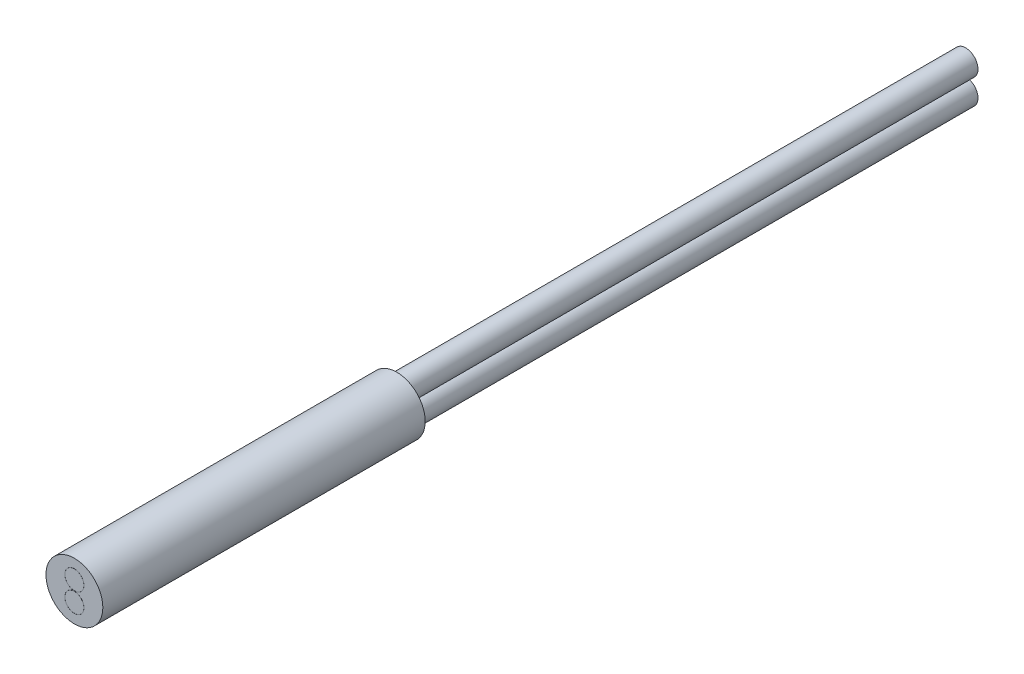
ISO-10303-21;
HEADER;
FILE_DESCRIPTION(('STEP AP214'),'2;1');
FILE_NAME('part.step','',(''),(''),'','','');
FILE_SCHEMA(('AUTOMOTIVE_DESIGN { 1 0 10303 214 1 1 1 1 }'));
ENDSEC;
DATA;
#1=APPLICATION_CONTEXT('core data for automotive mechanical design processes');
#2=APPLICATION_PROTOCOL_DEFINITION('international standard','automotive_design',2000,#1);
#3=PRODUCT_CONTEXT('',#1,'mechanical');
#4=PRODUCT('Part','Part','',(#3));
#5=PRODUCT_RELATED_PRODUCT_CATEGORY('part','',(#4));
#6=PRODUCT_DEFINITION_FORMATION('','',#4);
#7=PRODUCT_DEFINITION_CONTEXT('part definition',#1,'design');
#8=PRODUCT_DEFINITION('design','',#6,#7);
#9=PRODUCT_DEFINITION_SHAPE('','',#8);
#10=(LENGTH_UNIT() NAMED_UNIT(*) SI_UNIT(.MILLI.,.METRE.));
#11=(NAMED_UNIT(*) PLANE_ANGLE_UNIT() SI_UNIT($,.RADIAN.));
#12=(NAMED_UNIT(*) SI_UNIT($,.STERADIAN.) SOLID_ANGLE_UNIT());
#13=UNCERTAINTY_MEASURE_WITH_UNIT(LENGTH_MEASURE(1.E-05),#10,'distance_accuracy_value','');
#14=(GEOMETRIC_REPRESENTATION_CONTEXT(3) GLOBAL_UNCERTAINTY_ASSIGNED_CONTEXT((#13)) GLOBAL_UNIT_ASSIGNED_CONTEXT((#10,
#11,#12)) REPRESENTATION_CONTEXT('',''));
#15=CARTESIAN_POINT('',(0.,0.,0.));
#16=DIRECTION('',(0.,0.,1.));
#17=DIRECTION('',(1.,0.,0.));
#18=AXIS2_PLACEMENT_3D('',#15,#16,#17);
#19=CARTESIAN_POINT('',(0.,0.,-17.));
#20=DIRECTION('',(0.,0.,1.));
#21=DIRECTION('',(1.,0.,0.));
#22=AXIS2_PLACEMENT_3D('',#19,#20,#21);
#23=CYLINDRICAL_SURFACE('',#22,1.5);
#24=CARTESIAN_POINT('',(0.,0.,-17.));
#25=DIRECTION('',(0.,0.,1.));
#26=DIRECTION('',(1.,0.,0.));
#27=AXIS2_PLACEMENT_3D('',#24,#25,#26);
#28=CIRCLE('',#27,1.5);
#29=CARTESIAN_POINT('',(1.5,0.,-17.));
#30=VERTEX_POINT('',#29);
#31=EDGE_CURVE('E43',#30,#30,#28,.T.);
#32=ORIENTED_EDGE('',*,*,#31,.T.);
#33=EDGE_LOOP('',(#32));
#34=FACE_BOUND('',#33,.T.);
#35=CARTESIAN_POINT('',(0.,0.,0.));
#36=DIRECTION('',(0.,0.,1.));
#37=DIRECTION('',(1.,0.,0.));
#38=AXIS2_PLACEMENT_3D('',#35,#36,#37);
#39=CIRCLE('',#38,1.5);
#40=CARTESIAN_POINT('',(1.5,0.,0.));
#41=VERTEX_POINT('',#40);
#42=EDGE_CURVE('E47',#41,#41,#39,.T.);
#43=ORIENTED_EDGE('',*,*,#42,.F.);
#44=EDGE_LOOP('',(#43));
#45=FACE_BOUND('',#44,.T.);
#46=ADVANCED_FACE('F33',(#34,#45),#23,.T.);
#47=CARTESIAN_POINT('',(0.,0.,-17.));
#48=DIRECTION('',(0.,0.,1.));
#49=DIRECTION('',(1.,0.,0.));
#50=AXIS2_PLACEMENT_3D('',#47,#48,#49);
#51=PLANE('',#50);
#52=CARTESIAN_POINT('',(0.,-0.66,-17.));
#53=DIRECTION('',(0.,0.,1.));
#54=DIRECTION('',(1.,0.,0.));
#55=AXIS2_PLACEMENT_3D('',#52,#53,#54);
#56=CIRCLE('',#55,0.65);
#57=CARTESIAN_POINT('',(0.65,-0.66,-17.));
#58=VERTEX_POINT('',#57);
#59=EDGE_CURVE('E10',#58,#58,#56,.F.);
#60=ORIENTED_EDGE('',*,*,#59,.F.);
#61=EDGE_LOOP('',(#60));
#62=FACE_BOUND('',#61,.T.);
#63=CARTESIAN_POINT('',(0.,0.66,-17.));
#64=DIRECTION('',(0.,0.,1.));
#65=DIRECTION('',(1.,0.,0.));
#66=AXIS2_PLACEMENT_3D('',#63,#64,#65);
#67=CIRCLE('',#66,0.65);
#68=CARTESIAN_POINT('',(0.65,0.66,-17.));
#69=VERTEX_POINT('',#68);
#70=EDGE_CURVE('E39',#69,#69,#67,.F.);
#71=ORIENTED_EDGE('',*,*,#70,.F.);
#72=EDGE_LOOP('',(#71));
#73=FACE_BOUND('',#72,.T.);
#74=ORIENTED_EDGE('',*,*,#31,.F.);
#75=EDGE_LOOP('',(#74));
#76=FACE_BOUND('',#75,.T.);
#77=ADVANCED_FACE('F103',(#62,#73,#76),#51,.F.);
#78=CARTESIAN_POINT('',(0.,0.,0.));
#79=DIRECTION('',(0.,0.,1.));
#80=DIRECTION('',(1.,0.,0.));
#81=AXIS2_PLACEMENT_3D('',#78,#79,#80);
#82=PLANE('',#81);
#83=CARTESIAN_POINT('',(0.,0.515,0.));
#84=DIRECTION('',(0.,0.,1.));
#85=DIRECTION('',(1.,0.,0.));
#86=AXIS2_PLACEMENT_3D('',#83,#84,#85);
#87=CIRCLE('',#86,0.505);
#88=CARTESIAN_POINT('',(0.505,0.515,0.));
#89=VERTEX_POINT('',#88);
#90=EDGE_CURVE('E72',#89,#89,#87,.T.);
#91=ORIENTED_EDGE('',*,*,#90,.F.);
#92=EDGE_LOOP('',(#91));
#93=FACE_BOUND('',#92,.T.);
#94=CARTESIAN_POINT('',(0.,-0.515,0.));
#95=DIRECTION('',(0.,0.,1.));
#96=DIRECTION('',(1.,0.,0.));
#97=AXIS2_PLACEMENT_3D('',#94,#95,#96);
#98=CIRCLE('',#97,0.505);
#99=CARTESIAN_POINT('',(0.505,-0.515,0.));
#100=VERTEX_POINT('',#99);
#101=EDGE_CURVE('E59',#100,#100,#98,.T.);
#102=ORIENTED_EDGE('',*,*,#101,.F.);
#103=EDGE_LOOP('',(#102));
#104=FACE_BOUND('',#103,.T.);
#105=ORIENTED_EDGE('',*,*,#42,.T.);
#106=EDGE_LOOP('',(#105));
#107=FACE_BOUND('',#106,.T.);
#108=ADVANCED_FACE('F99',(#93,#104,#107),#82,.T.);
#109=CARTESIAN_POINT('',(0.,0.66,-47.));
#110=DIRECTION('',(0.,0.,1.));
#111=DIRECTION('',(1.,0.,0.));
#112=AXIS2_PLACEMENT_3D('',#109,#110,#111);
#113=CYLINDRICAL_SURFACE('',#112,0.65);
#114=CARTESIAN_POINT('',(0.,0.66,-47.));
#115=DIRECTION('',(0.,0.,-1.));
#116=DIRECTION('',(-1.,0.,0.));
#117=AXIS2_PLACEMENT_3D('',#114,#115,#116);
#118=CIRCLE('',#117,0.65);
#119=CARTESIAN_POINT('',(-0.65,0.66,-47.));
#120=VERTEX_POINT('',#119);
#121=EDGE_CURVE('E51',#120,#120,#118,.T.);
#122=ORIENTED_EDGE('',*,*,#121,.F.);
#123=EDGE_LOOP('',(#122));
#124=FACE_BOUND('',#123,.T.);
#125=ORIENTED_EDGE('',*,*,#70,.T.);
#126=EDGE_LOOP('',(#125));
#127=FACE_BOUND('',#126,.T.);
#128=ADVANCED_FACE('F102',(#124,#127),#113,.T.);
#129=CARTESIAN_POINT('',(0.,0.66,-47.));
#130=DIRECTION('',(0.,0.,-1.));
#131=DIRECTION('',(-1.,0.,0.));
#132=AXIS2_PLACEMENT_3D('',#129,#130,#131);
#133=PLANE('',#132);
#134=ORIENTED_EDGE('',*,*,#121,.T.);
#135=EDGE_LOOP('',(#134));
#136=FACE_BOUND('',#135,.T.);
#137=ADVANCED_FACE('F125',(#136),#133,.T.);
#138=CARTESIAN_POINT('',(0.,-0.66,-47.));
#139=DIRECTION('',(0.,0.,1.));
#140=DIRECTION('',(1.,0.,0.));
#141=AXIS2_PLACEMENT_3D('',#138,#139,#140);
#142=CYLINDRICAL_SURFACE('',#141,0.65);
#143=CARTESIAN_POINT('',(0.,-0.66,-47.));
#144=DIRECTION('',(0.,0.,-1.));
#145=DIRECTION('',(-1.,0.,0.));
#146=AXIS2_PLACEMENT_3D('',#143,#144,#145);
#147=CIRCLE('',#146,0.65);
#148=CARTESIAN_POINT('',(-0.65,-0.66,-47.));
#149=VERTEX_POINT('',#148);
#150=EDGE_CURVE('E55',#149,#149,#147,.T.);
#151=ORIENTED_EDGE('',*,*,#150,.F.);
#152=EDGE_LOOP('',(#151));
#153=FACE_BOUND('',#152,.T.);
#154=ORIENTED_EDGE('',*,*,#59,.T.);
#155=EDGE_LOOP('',(#154));
#156=FACE_BOUND('',#155,.T.);
#157=ADVANCED_FACE('F129',(#153,#156),#142,.T.);
#158=CARTESIAN_POINT('',(0.,-0.66,-47.));
#159=DIRECTION('',(0.,0.,-1.));
#160=DIRECTION('',(-1.,0.,0.));
#161=AXIS2_PLACEMENT_3D('',#158,#159,#160);
#162=PLANE('',#161);
#163=ORIENTED_EDGE('',*,*,#150,.T.);
#164=EDGE_LOOP('',(#163));
#165=FACE_BOUND('',#164,.T.);
#166=ADVANCED_FACE('F133',(#165),#162,.T.);
#167=CARTESIAN_POINT('',(0.,-0.515,-0.1));
#168=DIRECTION('',(0.,0.,1.));
#169=DIRECTION('',(1.,0.,0.));
#170=AXIS2_PLACEMENT_3D('',#167,#168,#169);
#171=CYLINDRICAL_SURFACE('',#170,0.505);
#172=CARTESIAN_POINT('',(0.,-0.515,-0.1));
#173=DIRECTION('',(0.,0.,1.));
#174=DIRECTION('',(1.,0.,0.));
#175=AXIS2_PLACEMENT_3D('',#172,#173,#174);
#176=CIRCLE('',#175,0.505);
#177=CARTESIAN_POINT('',(0.505,-0.515,-0.1));
#178=VERTEX_POINT('',#177);
#179=EDGE_CURVE('E62',#178,#178,#176,.T.);
#180=ORIENTED_EDGE('',*,*,#179,.F.);
#181=EDGE_LOOP('',(#180));
#182=FACE_BOUND('',#181,.T.);
#183=ORIENTED_EDGE('',*,*,#101,.T.);
#184=EDGE_LOOP('',(#183));
#185=FACE_BOUND('',#184,.T.);
#186=ADVANCED_FACE('F137',(#182,#185),#171,.F.);
#187=CARTESIAN_POINT('',(0.,-0.515,-0.1));
#188=DIRECTION('',(0.,0.,1.));
#189=DIRECTION('',(1.,0.,0.));
#190=AXIS2_PLACEMENT_3D('',#187,#188,#189);
#191=PLANE('',#190);
#192=CARTESIAN_POINT('',(0.,-0.515,-0.1));
#193=DIRECTION('',(0.,0.,1.));
#194=DIRECTION('',(1.,0.,0.));
#195=AXIS2_PLACEMENT_3D('',#192,#193,#194);
#196=CIRCLE('',#195,0.5);
#197=CARTESIAN_POINT('',(0.5,-0.515,-0.1));
#198=VERTEX_POINT('',#197);
#199=EDGE_CURVE('E63',#198,#198,#196,.T.);
#200=ORIENTED_EDGE('',*,*,#199,.F.);
#201=EDGE_LOOP('',(#200));
#202=FACE_BOUND('',#201,.T.);
#203=ORIENTED_EDGE('',*,*,#179,.T.);
#204=EDGE_LOOP('',(#203));
#205=FACE_BOUND('',#204,.T.);
#206=ADVANCED_FACE('F141',(#202,#205),#191,.T.);
#207=CARTESIAN_POINT('',(0.,-0.515,-0.1));
#208=DIRECTION('',(0.,0.,1.));
#209=DIRECTION('',(1.,0.,0.));
#210=AXIS2_PLACEMENT_3D('',#207,#208,#209);
#211=CYLINDRICAL_SURFACE('',#210,0.5);
#212=ORIENTED_EDGE('',*,*,#199,.T.);
#213=EDGE_LOOP('',(#212));
#214=FACE_BOUND('',#213,.T.);
#215=CARTESIAN_POINT('',(0.,-0.515,0.));
#216=DIRECTION('',(0.,0.,1.));
#217=DIRECTION('',(1.,0.,0.));
#218=AXIS2_PLACEMENT_3D('',#215,#216,#217);
#219=CIRCLE('',#218,0.5);
#220=CARTESIAN_POINT('',(0.5,-0.515,0.));
#221=VERTEX_POINT('',#220);
#222=EDGE_CURVE('E67',#221,#221,#219,.T.);
#223=ORIENTED_EDGE('',*,*,#222,.F.);
#224=EDGE_LOOP('',(#223));
#225=FACE_BOUND('',#224,.T.);
#226=ADVANCED_FACE('F95',(#214,#225),#211,.T.);
#227=CARTESIAN_POINT('',(0.,0.515,-0.1));
#228=DIRECTION('',(0.,0.,1.));
#229=DIRECTION('',(1.,0.,0.));
#230=AXIS2_PLACEMENT_3D('',#227,#228,#229);
#231=CYLINDRICAL_SURFACE('',#230,0.505);
#232=CARTESIAN_POINT('',(0.,0.515,-0.1));
#233=DIRECTION('',(0.,0.,1.));
#234=DIRECTION('',(1.,0.,0.));
#235=AXIS2_PLACEMENT_3D('',#232,#233,#234);
#236=CIRCLE('',#235,0.505);
#237=CARTESIAN_POINT('',(0.505,0.515,-0.1));
#238=VERTEX_POINT('',#237);
#239=EDGE_CURVE('E58',#238,#238,#236,.T.);
#240=ORIENTED_EDGE('',*,*,#239,.F.);
#241=EDGE_LOOP('',(#240));
#242=FACE_BOUND('',#241,.T.);
#243=ORIENTED_EDGE('',*,*,#90,.T.);
#244=EDGE_LOOP('',(#243));
#245=FACE_BOUND('',#244,.T.);
#246=ADVANCED_FACE('F89',(#242,#245),#231,.F.);
#247=CARTESIAN_POINT('',(0.,0.515,-0.1));
#248=DIRECTION('',(0.,0.,1.));
#249=DIRECTION('',(1.,0.,0.));
#250=AXIS2_PLACEMENT_3D('',#247,#248,#249);
#251=PLANE('',#250);
#252=CARTESIAN_POINT('',(0.,0.515,-0.1));
#253=DIRECTION('',(0.,0.,1.));
#254=DIRECTION('',(1.,0.,0.));
#255=AXIS2_PLACEMENT_3D('',#252,#253,#254);
#256=CIRCLE('',#255,0.5);
#257=CARTESIAN_POINT('',(0.5,0.515,-0.1));
#258=VERTEX_POINT('',#257);
#259=EDGE_CURVE('E75',#258,#258,#256,.T.);
#260=ORIENTED_EDGE('',*,*,#259,.F.);
#261=EDGE_LOOP('',(#260));
#262=FACE_BOUND('',#261,.T.);
#263=ORIENTED_EDGE('',*,*,#239,.T.);
#264=EDGE_LOOP('',(#263));
#265=FACE_BOUND('',#264,.T.);
#266=ADVANCED_FACE('F86',(#262,#265),#251,.T.);
#267=CARTESIAN_POINT('',(0.,0.515,-0.1));
#268=DIRECTION('',(0.,0.,1.));
#269=DIRECTION('',(1.,0.,0.));
#270=AXIS2_PLACEMENT_3D('',#267,#268,#269);
#271=CYLINDRICAL_SURFACE('',#270,0.5);
#272=ORIENTED_EDGE('',*,*,#259,.T.);
#273=EDGE_LOOP('',(#272));
#274=FACE_BOUND('',#273,.T.);
#275=CARTESIAN_POINT('',(0.,0.515,0.));
#276=DIRECTION('',(0.,0.,1.));
#277=DIRECTION('',(1.,0.,0.));
#278=AXIS2_PLACEMENT_3D('',#275,#276,#277);
#279=CIRCLE('',#278,0.5);
#280=CARTESIAN_POINT('',(0.5,0.515,0.));
#281=VERTEX_POINT('',#280);
#282=EDGE_CURVE('E66',#281,#281,#279,.T.);
#283=ORIENTED_EDGE('',*,*,#282,.F.);
#284=EDGE_LOOP('',(#283));
#285=FACE_BOUND('',#284,.T.);
#286=ADVANCED_FACE('F83',(#274,#285),#271,.T.);
#287=ORIENTED_EDGE('',*,*,#222,.T.);
#288=EDGE_LOOP('',(#287));
#289=FACE_BOUND('',#288,.T.);
#290=ADVANCED_FACE('F105',(#289),#82,.T.);
#291=ORIENTED_EDGE('',*,*,#282,.T.);
#292=EDGE_LOOP('',(#291));
#293=FACE_BOUND('',#292,.T.);
#294=ADVANCED_FACE('F104',(#293),#82,.T.);
#295=CLOSED_SHELL('',(#46,#77,#108,#128,#137,#157,#166,#186,#206,#226,#246,#266,#286,#290,#294));
#296=MANIFOLD_SOLID_BREP('B2',#295);
#297=ADVANCED_BREP_SHAPE_REPRESENTATION('',(#18,#296),#14);
#298=SHAPE_DEFINITION_REPRESENTATION(#9,#297);
ENDSEC;
END-ISO-10303-21;
